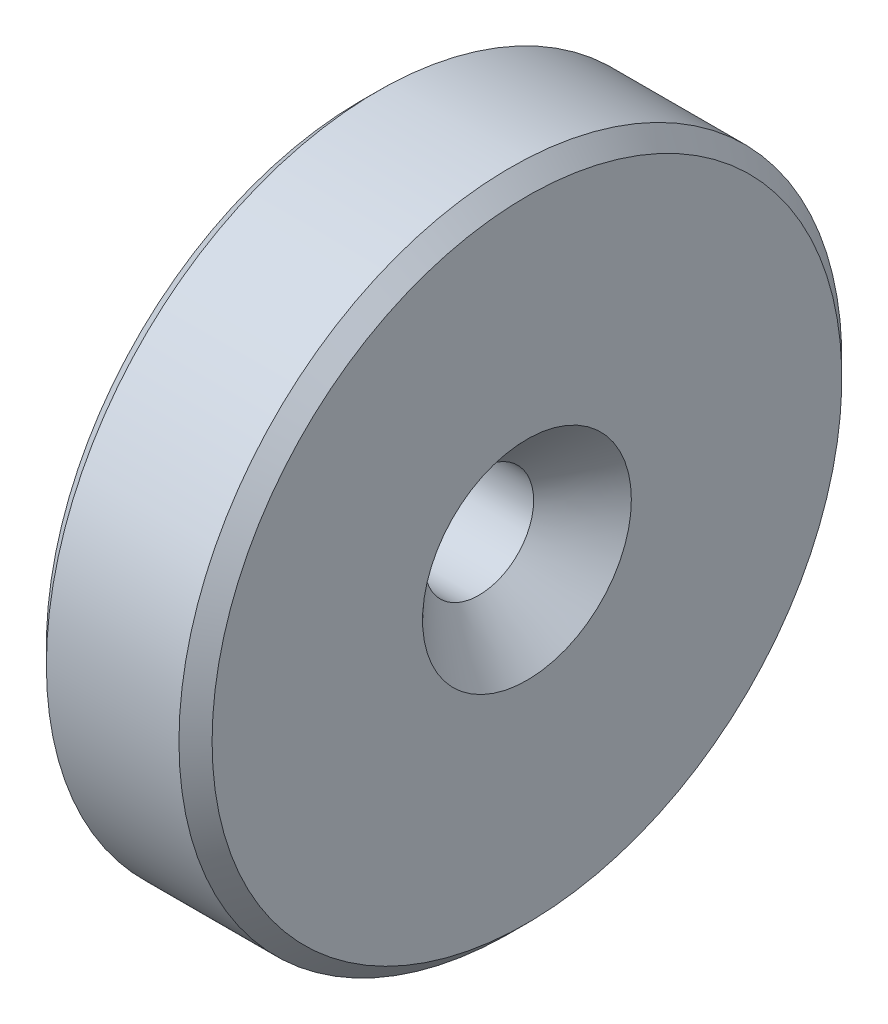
ISO-10303-21;
HEADER;
FILE_DESCRIPTION(('STEP AP214'),'2;1');
FILE_NAME('part.step','',(''),(''),'','','');
FILE_SCHEMA(('AUTOMOTIVE_DESIGN { 1 0 10303 214 1 1 1 1 }'));
ENDSEC;
DATA;
#1=APPLICATION_CONTEXT('core data for automotive mechanical design processes');
#2=APPLICATION_PROTOCOL_DEFINITION('international standard','automotive_design',2000,#1);
#3=PRODUCT_CONTEXT('',#1,'mechanical');
#4=PRODUCT('Part','Part','',(#3));
#5=PRODUCT_RELATED_PRODUCT_CATEGORY('part','',(#4));
#6=PRODUCT_DEFINITION_FORMATION('','',#4);
#7=PRODUCT_DEFINITION_CONTEXT('part definition',#1,'design');
#8=PRODUCT_DEFINITION('design','',#6,#7);
#9=PRODUCT_DEFINITION_SHAPE('','',#8);
#10=(LENGTH_UNIT() NAMED_UNIT(*) SI_UNIT(.MILLI.,.METRE.));
#11=(NAMED_UNIT(*) PLANE_ANGLE_UNIT() SI_UNIT($,.RADIAN.));
#12=(NAMED_UNIT(*) SI_UNIT($,.STERADIAN.) SOLID_ANGLE_UNIT());
#13=UNCERTAINTY_MEASURE_WITH_UNIT(LENGTH_MEASURE(1.E-05),#10,'distance_accuracy_value','');
#14=(GEOMETRIC_REPRESENTATION_CONTEXT(3) GLOBAL_UNCERTAINTY_ASSIGNED_CONTEXT((#13)) GLOBAL_UNIT_ASSIGNED_CONTEXT((#10,
#11,#12)) REPRESENTATION_CONTEXT('',''));
#15=CARTESIAN_POINT('',(0.,0.,0.));
#16=DIRECTION('',(0.,0.,1.));
#17=DIRECTION('',(1.,0.,0.));
#18=AXIS2_PLACEMENT_3D('',#15,#16,#17);
#19=CARTESIAN_POINT('',(0.,0.,0.));
#20=DIRECTION('',(1.,0.,0.));
#21=DIRECTION('',(0.,0.,-1.));
#22=AXIS2_PLACEMENT_3D('',#19,#20,#21);
#23=PLANE('',#22);
#24=CARTESIAN_POINT('',(0.,0.,0.));
#25=DIRECTION('',(1.,0.,0.));
#26=DIRECTION('',(0.,0.,-1.));
#27=AXIS2_PLACEMENT_3D('',#24,#25,#26);
#28=CIRCLE('',#27,19.);
#29=CARTESIAN_POINT('',(0.,18.9995888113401,-0.124999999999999));
#30=VERTEX_POINT('',#29);
#31=CARTESIAN_POINT('',(0.,-18.9995888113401,-0.124999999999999));
#32=VERTEX_POINT('',#31);
#33=EDGE_CURVE('E155',#30,#32,#28,.F.);
#34=ORIENTED_EDGE('',*,*,#33,.T.);
#35=DIRECTION('',(0.,1.,0.));
#36=VECTOR('',#35,1.);
#37=CARTESIAN_POINT('',(0.,0.,-0.124999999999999));
#38=LINE('',#37,#36);
#39=CARTESIAN_POINT('',(0.,-3.29763172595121,-0.124999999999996));
#40=VERTEX_POINT('',#39);
#41=EDGE_CURVE('E110',#32,#40,#38,.T.);
#42=ORIENTED_EDGE('',*,*,#41,.T.);
#43=CARTESIAN_POINT('',(0.,0.,0.));
#44=DIRECTION('',(1.,0.,0.));
#45=DIRECTION('',(0.,0.,-1.));
#46=AXIS2_PLACEMENT_3D('',#43,#44,#45);
#47=CIRCLE('',#46,3.3);
#48=CARTESIAN_POINT('',(0.,3.29763172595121,-0.124999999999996));
#49=VERTEX_POINT('',#48);
#50=EDGE_CURVE('E156',#40,#49,#47,.T.);
#51=ORIENTED_EDGE('',*,*,#50,.T.);
#52=EDGE_CURVE('E157',#49,#30,#38,.T.);
#53=ORIENTED_EDGE('',*,*,#52,.T.);
#54=EDGE_LOOP('',(#34,#42,#51,#53));
#55=FACE_BOUND('',#54,.T.);
#56=ADVANCED_FACE('F34',(#55),#23,.F.);
#57=CARTESIAN_POINT('',(0.,-18.9995888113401,0.124999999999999));
#58=VERTEX_POINT('',#57);
#59=CARTESIAN_POINT('',(0.,18.9995888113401,0.124999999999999));
#60=VERTEX_POINT('',#59);
#61=EDGE_CURVE('E123',#58,#60,#28,.F.);
#62=ORIENTED_EDGE('',*,*,#61,.T.);
#63=DIRECTION('',(0.,-1.,0.));
#64=VECTOR('',#63,1.);
#65=CARTESIAN_POINT('',(0.,0.,0.124999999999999));
#66=LINE('',#65,#64);
#67=CARTESIAN_POINT('',(0.,3.29763172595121,0.124999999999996));
#68=VERTEX_POINT('',#67);
#69=EDGE_CURVE('E127',#60,#68,#66,.T.);
#70=ORIENTED_EDGE('',*,*,#69,.T.);
#71=CARTESIAN_POINT('',(0.,-3.29763172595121,0.124999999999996));
#72=VERTEX_POINT('',#71);
#73=EDGE_CURVE('E161',#68,#72,#47,.T.);
#74=ORIENTED_EDGE('',*,*,#73,.T.);
#75=EDGE_CURVE('E57',#72,#58,#66,.T.);
#76=ORIENTED_EDGE('',*,*,#75,.T.);
#77=EDGE_LOOP('',(#62,#70,#74,#76));
#78=FACE_BOUND('',#77,.T.);
#79=ADVANCED_FACE('F36',(#78),#23,.F.);
#80=CARTESIAN_POINT('',(0.,0.,0.));
#81=DIRECTION('',(-1.,0.,0.));
#82=DIRECTION('',(0.,0.,1.));
#83=AXIS2_PLACEMENT_3D('',#80,#81,#82);
#84=CYLINDRICAL_SURFACE('',#83,20.);
#85=CARTESIAN_POINT('',(8.99999999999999,0.,0.));
#86=DIRECTION('',(-1.,0.,0.));
#87=DIRECTION('',(0.,0.,1.));
#88=AXIS2_PLACEMENT_3D('',#85,#86,#87);
#89=CIRCLE('',#88,20.);
#90=CARTESIAN_POINT('',(8.99999999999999,0.,20.));
#91=VERTEX_POINT('',#90);
#92=EDGE_CURVE('E186',#91,#91,#89,.T.);
#93=ORIENTED_EDGE('',*,*,#92,.T.);
#94=EDGE_LOOP('',(#93));
#95=FACE_BOUND('',#94,.T.);
#96=CARTESIAN_POINT('',(1.00000000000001,0.,0.));
#97=DIRECTION('',(1.,0.,0.));
#98=DIRECTION('',(0.,0.,-1.));
#99=AXIS2_PLACEMENT_3D('',#96,#97,#98);
#100=CIRCLE('',#99,20.);
#101=CARTESIAN_POINT('',(1.00000000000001,0.,-20.));
#102=VERTEX_POINT('',#101);
#103=EDGE_CURVE('E189',#102,#102,#100,.T.);
#104=ORIENTED_EDGE('',*,*,#103,.T.);
#105=EDGE_LOOP('',(#104));
#106=FACE_BOUND('',#105,.T.);
#107=ADVANCED_FACE('F212',(#95,#106),#84,.T.);
#108=CARTESIAN_POINT('',(10.,0.,0.));
#109=DIRECTION('',(-1.,0.,0.));
#110=DIRECTION('',(0.,0.,1.));
#111=AXIS2_PLACEMENT_3D('',#108,#109,#110);
#112=PLANE('',#111);
#113=CARTESIAN_POINT('',(10.,0.,0.));
#114=DIRECTION('',(1.,0.,0.));
#115=DIRECTION('',(0.,0.,-1.));
#116=AXIS2_PLACEMENT_3D('',#113,#114,#115);
#117=CIRCLE('',#116,6.3);
#118=CARTESIAN_POINT('',(10.,0.,-6.3));
#119=VERTEX_POINT('',#118);
#120=EDGE_CURVE('E192',#119,#119,#117,.T.);
#121=ORIENTED_EDGE('',*,*,#120,.F.);
#122=EDGE_LOOP('',(#121));
#123=FACE_BOUND('',#122,.T.);
#124=CARTESIAN_POINT('',(10.,0.,0.));
#125=DIRECTION('',(-1.,0.,0.));
#126=DIRECTION('',(0.,0.,1.));
#127=AXIS2_PLACEMENT_3D('',#124,#125,#126);
#128=CIRCLE('',#127,19.);
#129=CARTESIAN_POINT('',(10.,0.,19.));
#130=VERTEX_POINT('',#129);
#131=EDGE_CURVE('E183',#130,#130,#128,.F.);
#132=ORIENTED_EDGE('',*,*,#131,.T.);
#133=EDGE_LOOP('',(#132));
#134=FACE_BOUND('',#133,.T.);
#135=ADVANCED_FACE('F216',(#123,#134),#112,.F.);
#136=CARTESIAN_POINT('',(8.99999999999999,0.,0.));
#137=DIRECTION('',(-1.,0.,0.));
#138=DIRECTION('',(0.,0.,1.));
#139=AXIS2_PLACEMENT_3D('',#136,#137,#138);
#140=CONICAL_SURFACE('',#139,20.,0.785398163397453);
#141=ORIENTED_EDGE('',*,*,#131,.F.);
#142=EDGE_LOOP('',(#141));
#143=FACE_BOUND('',#142,.T.);
#144=ORIENTED_EDGE('',*,*,#92,.F.);
#145=EDGE_LOOP('',(#144));
#146=FACE_BOUND('',#145,.T.);
#147=ADVANCED_FACE('F221',(#143,#146),#140,.T.);
#148=CARTESIAN_POINT('',(0.,0.,0.));
#149=DIRECTION('',(1.,0.,0.));
#150=DIRECTION('',(0.,0.,-1.));
#151=AXIS2_PLACEMENT_3D('',#148,#149,#150);
#152=CONICAL_SURFACE('',#151,19.,0.785398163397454);
#153=CARTESIAN_POINT('',(24.1002749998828,43.1000937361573,-0.124999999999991));
#154=CARTESIAN_POINT('',(21.1248248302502,40.1246305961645,-0.124999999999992));
#155=CARTESIAN_POINT('',(18.149375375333,37.1491667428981,-0.124999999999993));
#156=CARTESIAN_POINT('',(12.1984820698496,31.1982334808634,-0.124999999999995));
#157=CARTESIAN_POINT('',(9.2230382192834,28.2227640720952,-0.124999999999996));
#158=CARTESIAN_POINT('',(3.27216738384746,22.2718226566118,-0.124999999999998));
#159=CARTESIAN_POINT('',(0.296740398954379,19.2963506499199,-0.124999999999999));
#160=CARTESIAN_POINT('',(-4.16636716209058,14.8331096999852,-0.125000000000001));
#161=CARTESIAN_POINT('',(-5.65406420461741,13.3453572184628,-0.125000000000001));
#162=CARTESIAN_POINT('',(-8.62943346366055,10.3698274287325,-0.125000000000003));
#163=CARTESIAN_POINT('',(-10.117105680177,8.88205012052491,-0.125000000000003));
#164=CARTESIAN_POINT('',(-12.4205669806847,6.57826009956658,-0.125000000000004));
#165=CARTESIAN_POINT('',(-13.2363935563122,5.76228485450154,-0.125000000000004));
#166=CARTESIAN_POINT('',(-14.5979126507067,4.40033576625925,-0.125000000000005));
#167=CARTESIAN_POINT('',(-15.1436352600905,3.85439203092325,-0.125000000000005));
#168=CARTESIAN_POINT('',(-16.0543039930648,2.94307591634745,-0.125000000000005));
#169=CARTESIAN_POINT('',(-16.4192962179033,2.57774956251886,-0.125000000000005));
#170=CARTESIAN_POINT('',(-17.0282658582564,1.96782132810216,-0.125000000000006));
#171=CARTESIAN_POINT('',(-17.2723096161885,1.72328581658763,-0.125000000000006));
#172=CARTESIAN_POINT('',(-17.6793012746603,1.3148423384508,-0.125000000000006));
#173=CARTESIAN_POINT('',(-17.8423538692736,1.15103856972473,-0.125000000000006));
#174=CARTESIAN_POINT('',(-18.1140495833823,0.877212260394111,-0.125000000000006));
#175=CARTESIAN_POINT('',(-18.2228380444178,0.767334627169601,-0.125000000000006));
#176=CARTESIAN_POINT('',(-18.3674335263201,0.62012660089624,-0.125000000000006));
#177=CARTESIAN_POINT('',(-18.4036294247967,0.583178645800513,-0.125000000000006));
#178=CARTESIAN_POINT('',(-18.4758404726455,0.509106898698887,-0.125000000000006));
#179=CARTESIAN_POINT('',(-18.5118556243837,0.471983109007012,-0.125000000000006));
#180=CARTESIAN_POINT('',(-18.571682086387,0.409728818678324,-0.125000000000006));
#181=CARTESIAN_POINT('',(-18.5955906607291,0.384691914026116,-0.125000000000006));
#182=CARTESIAN_POINT('',(-18.6431250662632,0.334372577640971,-0.125000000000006));
#183=CARTESIAN_POINT('',(-18.6667510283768,0.309090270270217,-0.125000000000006));
#184=CARTESIAN_POINT('',(-18.705746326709,0.266471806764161,-0.125000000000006));
#185=CARTESIAN_POINT('',(-18.7212632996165,0.249271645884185,-0.125000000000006));
#186=CARTESIAN_POINT('',(-18.7518975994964,0.21447337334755,-0.125000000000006));
#187=CARTESIAN_POINT('',(-18.7670143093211,0.196874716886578,-0.125000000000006));
#188=CARTESIAN_POINT('',(-18.7947680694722,0.163035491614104,-0.125000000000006));
#189=CARTESIAN_POINT('',(-18.8074915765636,0.14686817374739,-0.125000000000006));
#190=CARTESIAN_POINT('',(-18.8255214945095,0.121860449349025,-0.125000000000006));
#191=CARTESIAN_POINT('',(-18.8313528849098,0.113402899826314,-0.125000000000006));
#192=CARTESIAN_POINT('',(-18.8424512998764,0.0961292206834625,-0.125000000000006));
#193=CARTESIAN_POINT('',(-18.8477189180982,0.0873134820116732,-0.125000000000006));
#194=CARTESIAN_POINT('',(-18.856726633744,0.0703361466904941,-0.125000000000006));
#195=CARTESIAN_POINT('',(-18.860575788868,0.0622338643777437,-0.125000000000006));
#196=CARTESIAN_POINT('',(-18.8671632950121,0.0455901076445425,-0.125000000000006));
#197=CARTESIAN_POINT('',(-18.8699046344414,0.0370498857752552,-0.125000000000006));
#198=CARTESIAN_POINT('',(-18.8734188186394,0.0211330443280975,-0.125000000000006));
#199=CARTESIAN_POINT('',(-18.874453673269,0.0138170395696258,-0.125000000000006));
#200=CARTESIAN_POINT('',(-18.8752114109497,-0.000872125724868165,-0.125000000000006));
#201=CARTESIAN_POINT('',(-18.874936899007,-0.00824514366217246,-0.125000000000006));
#202=CARTESIAN_POINT('',(-18.8729404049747,-0.0244426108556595,-0.125000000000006));
#203=CARTESIAN_POINT('',(-18.8709118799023,-0.0332276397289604,-0.125000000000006));
#204=CARTESIAN_POINT('',(-18.8654766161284,-0.0503847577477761,-0.125000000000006));
#205=CARTESIAN_POINT('',(-18.8620618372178,-0.0587541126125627,-0.125000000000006));
#206=CARTESIAN_POINT('',(-18.8507261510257,-0.0828103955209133,-0.125000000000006));
#207=CARTESIAN_POINT('',(-18.8416035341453,-0.0979074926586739,-0.125000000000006));
#208=CARTESIAN_POINT('',(-18.8219838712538,-0.127200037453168,-0.125000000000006));
#209=CARTESIAN_POINT('',(-18.8114803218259,-0.141390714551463,-0.125000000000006));
#210=CARTESIAN_POINT('',(-18.789673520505,-0.169379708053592,-0.125000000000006));
#211=CARTESIAN_POINT('',(-18.778363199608,-0.183172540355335,-0.125000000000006));
#212=CARTESIAN_POINT('',(-18.7553839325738,-0.210390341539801,-0.125000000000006));
#213=CARTESIAN_POINT('',(-18.7437159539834,-0.223816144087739,-0.125000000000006));
#214=CARTESIAN_POINT('',(-18.7088802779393,-0.263204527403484,-0.125000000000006));
#215=CARTESIAN_POINT('',(-18.6853861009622,-0.288877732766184,-0.125000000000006));
#216=CARTESIAN_POINT('',(-18.6380003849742,-0.3398557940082,-0.125000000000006));
#217=CARTESIAN_POINT('',(-18.6141087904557,-0.365160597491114,-0.125000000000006));
#218=CARTESIAN_POINT('',(-18.5420591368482,-0.440829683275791,-0.125000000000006));
#219=CARTESIAN_POINT('',(-18.4935810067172,-0.490889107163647,-0.125000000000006));
#220=CARTESIAN_POINT('',(-18.3967367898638,-0.590265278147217,-0.125000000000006));
#221=CARTESIAN_POINT('',(-18.3483734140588,-0.639584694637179,-0.125000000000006));
#222=CARTESIAN_POINT('',(-18.2515032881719,-0.738038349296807,-0.125000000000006));
#223=CARTESIAN_POINT('',(-18.202996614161,-0.787172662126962,-0.125000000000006));
#224=CARTESIAN_POINT('',(-18.0571890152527,-0.93460253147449,-0.125000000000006));
#225=CARTESIAN_POINT('',(-17.9597557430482,-1.03276693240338,-0.125000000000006));
#226=CARTESIAN_POINT('',(-17.7647472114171,-1.22895515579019,-0.125000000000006));
#227=CARTESIAN_POINT('',(-17.6671719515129,-1.32697897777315,-0.125000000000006));
#228=CARTESIAN_POINT('',(-17.3743041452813,-1.62097790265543,-0.125000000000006));
#229=CARTESIAN_POINT('',(-17.1789040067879,-1.81684579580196,-0.125000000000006));
#230=CARTESIAN_POINT('',(-16.7873393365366,-2.20915627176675,-0.125000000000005));
#231=CARTESIAN_POINT('',(-16.5911744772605,-2.40559852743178,-0.125000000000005));
#232=CARTESIAN_POINT('',(-16.1988045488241,-2.79842093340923,-0.125000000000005));
#233=CARTESIAN_POINT('',(-16.0025994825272,-2.9948010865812,-0.125000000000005));
#234=CARTESIAN_POINT('',(-15.0221453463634,-3.97601577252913,-0.125000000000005));
#235=CARTESIAN_POINT('',(-14.2377249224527,-4.76067905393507,-0.125000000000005));
#236=CARTESIAN_POINT('',(-12.6688121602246,-6.32996653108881,-0.125000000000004));
#237=CARTESIAN_POINT('',(-11.8843198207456,-7.11459072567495,-0.125000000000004));
#238=CARTESIAN_POINT('',(-10.3167642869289,-8.68234705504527,-0.125000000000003));
#239=CARTESIAN_POINT('',(-9.53370115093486,-9.46547924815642,-0.125000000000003));
#240=CARTESIAN_POINT('',(-7.96756817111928,-11.031726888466,-0.125000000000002));
#241=CARTESIAN_POINT('',(-7.18449832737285,-11.8148423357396,-0.125000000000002));
#242=CARTESIAN_POINT('',(-3.86502376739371,-15.1344831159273,-0.125000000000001));
#243=CARTESIAN_POINT('',(-1.32858871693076,-17.6709781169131,-0.125));
#244=CARTESIAN_POINT('',(3.7443018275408,-22.7439617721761,-0.124999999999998));
#245=CARTESIAN_POINT('',(6.28075732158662,-25.280450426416,-0.124999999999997));
#246=CARTESIAN_POINT('',(11.3643915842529,-30.364136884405,-0.124999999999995));
#247=CARTESIAN_POINT('',(13.911570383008,-32.9113346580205,-0.124999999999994));
#248=CARTESIAN_POINT('',(19.0059244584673,-38.0057195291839,-0.124999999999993));
#249=CARTESIAN_POINT('',(21.5530997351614,-40.5529066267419,-0.124999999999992));
#250=CARTESIAN_POINT('',(24.1002749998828,-43.1000937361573,-0.124999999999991));
#251=B_SPLINE_CURVE_WITH_KNOTS('',3,(#153,#154,#155,#156,#157,#158,#159,#160,#161,#162,#163,
#164,#165,#166,#167,#168,#169,#170,#171,#172,#173,#174,#175,#176,#177,#178,#179,#180,#181,#182,
#183,#184,#185,#186,#187,#188,#189,#190,#191,#192,#193,#194,#195,#196,#197,#198,#199,#200,#201,
#202,#203,#204,#205,#206,#207,#208,#209,#210,#211,#212,#213,#214,#215,#216,#217,#218,#219,#220,
#221,#222,#223,#224,#225,#226,#227,#228,#229,#230,#231,#232,#233,#234,#235,#236,#237,#238,#239,
#240,#241,#242,#243,#244,#245,#246,#247,#248,#249,#250),.UNSPECIFIED.,.F.,.F.,(4,2,2,2,2,2,2,2,
2,2,2,2,2,2,2,2,2,2,2,2,2,2,2,2,2,2,2,2,2,2,2,2,2,2,2,2,2,2,2,2,2,2,2,2,2,2,2,2,4),(0.,
12.6237934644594,25.2475868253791,37.8713499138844,44.1832315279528,50.4951131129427,
53.9566875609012,56.2724615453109,57.8217015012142,58.8581347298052,59.5515039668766,
60.0153681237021,60.1705376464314,60.3257051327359,60.4295608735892,60.5333664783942,
60.6028571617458,60.6724493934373,60.7341248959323,60.7649313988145,60.7957051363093,
60.8225667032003,60.8493553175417,60.8714165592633,60.8934339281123,60.9203181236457,
60.9473605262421,61.0000559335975,61.0530090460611,61.1065027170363,61.1598626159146,
61.2642516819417,61.3686554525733,61.5777057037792,61.7849325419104,61.9920641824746,
62.4069921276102,62.8219214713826,63.651926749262,64.4847724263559,65.3175715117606,
68.6461006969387,71.9746995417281,75.2971015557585,78.6194822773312,89.3807919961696,
100.142131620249,110.948936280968,121.755710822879),.UNSPECIFIED.);
#252=CARTESIAN_POINT('',(0.0999999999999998,-19.0995909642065,-0.124999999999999));
#253=VERTEX_POINT('',#252);
#254=EDGE_CURVE('E159',#32,#253,#251,.T.);
#255=ORIENTED_EDGE('',*,*,#254,.F.);
#256=ORIENTED_EDGE('',*,*,#33,.F.);
#257=CARTESIAN_POINT('',(0.0999999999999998,19.0995909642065,-0.124999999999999));
#258=VERTEX_POINT('',#257);
#259=EDGE_CURVE('E146',#258,#30,#251,.T.);
#260=ORIENTED_EDGE('',*,*,#259,.F.);
#261=CARTESIAN_POINT('',(0.0999999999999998,0.,0.));
#262=DIRECTION('',(1.,0.,0.));
#263=DIRECTION('',(0.,0.,-1.));
#264=AXIS2_PLACEMENT_3D('',#261,#262,#263);
#265=CIRCLE('',#264,19.1);
#266=CARTESIAN_POINT('',(0.0999999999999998,19.0995909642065,0.124999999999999));
#267=VERTEX_POINT('',#266);
#268=EDGE_CURVE('E111',#267,#258,#265,.F.);
#269=ORIENTED_EDGE('',*,*,#268,.F.);
#270=CARTESIAN_POINT('',(24.1002749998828,-43.1000937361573,0.124999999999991));
#271=CARTESIAN_POINT('',(21.1248248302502,-40.1246305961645,0.124999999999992));
#272=CARTESIAN_POINT('',(18.149375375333,-37.1491667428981,0.124999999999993));
#273=CARTESIAN_POINT('',(12.1984820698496,-31.1982334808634,0.124999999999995));
#274=CARTESIAN_POINT('',(9.2230382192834,-28.2227640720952,0.124999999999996));
#275=CARTESIAN_POINT('',(3.27216738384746,-22.2718226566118,0.124999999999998));
#276=CARTESIAN_POINT('',(0.296740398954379,-19.2963506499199,0.124999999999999));
#277=CARTESIAN_POINT('',(-4.16636716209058,-14.8331096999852,0.125000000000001));
#278=CARTESIAN_POINT('',(-5.65406420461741,-13.3453572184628,0.125000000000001));
#279=CARTESIAN_POINT('',(-8.62943346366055,-10.3698274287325,0.125000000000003));
#280=CARTESIAN_POINT('',(-10.117105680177,-8.88205012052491,0.125000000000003));
#281=CARTESIAN_POINT('',(-12.4205669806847,-6.57826009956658,0.125000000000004));
#282=CARTESIAN_POINT('',(-13.2363935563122,-5.76228485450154,0.125000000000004));
#283=CARTESIAN_POINT('',(-14.5979126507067,-4.40033576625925,0.125000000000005));
#284=CARTESIAN_POINT('',(-15.1436352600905,-3.85439203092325,0.125000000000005));
#285=CARTESIAN_POINT('',(-16.0543039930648,-2.94307591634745,0.125000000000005));
#286=CARTESIAN_POINT('',(-16.4192962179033,-2.57774956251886,0.125000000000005));
#287=CARTESIAN_POINT('',(-17.0282658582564,-1.96782132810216,0.125000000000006));
#288=CARTESIAN_POINT('',(-17.2723096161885,-1.72328581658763,0.125000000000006));
#289=CARTESIAN_POINT('',(-17.6793012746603,-1.3148423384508,0.125000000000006));
#290=CARTESIAN_POINT('',(-17.8423538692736,-1.15103856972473,0.125000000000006));
#291=CARTESIAN_POINT('',(-18.1140495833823,-0.877212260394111,0.125000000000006));
#292=CARTESIAN_POINT('',(-18.2228380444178,-0.767334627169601,0.125000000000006));
#293=CARTESIAN_POINT('',(-18.3674335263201,-0.62012660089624,0.125000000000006));
#294=CARTESIAN_POINT('',(-18.4036294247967,-0.583178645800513,0.125000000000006));
#295=CARTESIAN_POINT('',(-18.4758404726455,-0.509106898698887,0.125000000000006));
#296=CARTESIAN_POINT('',(-18.5118556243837,-0.471983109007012,0.125000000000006));
#297=CARTESIAN_POINT('',(-18.571682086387,-0.409728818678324,0.125000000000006));
#298=CARTESIAN_POINT('',(-18.5955906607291,-0.384691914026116,0.125000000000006));
#299=CARTESIAN_POINT('',(-18.6431250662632,-0.334372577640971,0.125000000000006));
#300=CARTESIAN_POINT('',(-18.6667510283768,-0.309090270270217,0.125000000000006));
#301=CARTESIAN_POINT('',(-18.705746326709,-0.266471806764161,0.125000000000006));
#302=CARTESIAN_POINT('',(-18.7212632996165,-0.249271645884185,0.125000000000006));
#303=CARTESIAN_POINT('',(-18.7518975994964,-0.21447337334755,0.125000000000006));
#304=CARTESIAN_POINT('',(-18.7670143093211,-0.196874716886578,0.125000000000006));
#305=CARTESIAN_POINT('',(-18.7947680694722,-0.163035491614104,0.125000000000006));
#306=CARTESIAN_POINT('',(-18.8074915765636,-0.14686817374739,0.125000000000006));
#307=CARTESIAN_POINT('',(-18.8255214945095,-0.121860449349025,0.125000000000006));
#308=CARTESIAN_POINT('',(-18.8313528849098,-0.113402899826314,0.125000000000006));
#309=CARTESIAN_POINT('',(-18.8424512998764,-0.0961292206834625,0.125000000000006));
#310=CARTESIAN_POINT('',(-18.8477189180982,-0.0873134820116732,0.125000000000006));
#311=CARTESIAN_POINT('',(-18.856726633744,-0.0703361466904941,0.125000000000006));
#312=CARTESIAN_POINT('',(-18.860575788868,-0.0622338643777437,0.125000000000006));
#313=CARTESIAN_POINT('',(-18.8671632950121,-0.0455901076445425,0.125000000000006));
#314=CARTESIAN_POINT('',(-18.8699046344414,-0.0370498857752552,0.125000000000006));
#315=CARTESIAN_POINT('',(-18.8734188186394,-0.0211330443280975,0.125000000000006));
#316=CARTESIAN_POINT('',(-18.874453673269,-0.0138170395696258,0.125000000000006));
#317=CARTESIAN_POINT('',(-18.8752114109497,0.000872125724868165,0.125000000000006));
#318=CARTESIAN_POINT('',(-18.874936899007,0.00824514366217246,0.125000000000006));
#319=CARTESIAN_POINT('',(-18.8729404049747,0.0244426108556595,0.125000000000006));
#320=CARTESIAN_POINT('',(-18.8709118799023,0.0332276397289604,0.125000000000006));
#321=CARTESIAN_POINT('',(-18.8654766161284,0.0503847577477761,0.125000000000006));
#322=CARTESIAN_POINT('',(-18.8620618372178,0.0587541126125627,0.125000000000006));
#323=CARTESIAN_POINT('',(-18.8507261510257,0.0828103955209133,0.125000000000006));
#324=CARTESIAN_POINT('',(-18.8416035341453,0.0979074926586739,0.125000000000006));
#325=CARTESIAN_POINT('',(-18.8219838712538,0.127200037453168,0.125000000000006));
#326=CARTESIAN_POINT('',(-18.8114803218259,0.141390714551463,0.125000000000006));
#327=CARTESIAN_POINT('',(-18.789673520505,0.169379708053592,0.125000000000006));
#328=CARTESIAN_POINT('',(-18.778363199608,0.183172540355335,0.125000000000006));
#329=CARTESIAN_POINT('',(-18.7553839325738,0.210390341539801,0.125000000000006));
#330=CARTESIAN_POINT('',(-18.7437159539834,0.223816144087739,0.125000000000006));
#331=CARTESIAN_POINT('',(-18.7088802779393,0.263204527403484,0.125000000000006));
#332=CARTESIAN_POINT('',(-18.6853861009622,0.288877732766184,0.125000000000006));
#333=CARTESIAN_POINT('',(-18.6380003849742,0.3398557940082,0.125000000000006));
#334=CARTESIAN_POINT('',(-18.6141087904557,0.365160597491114,0.125000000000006));
#335=CARTESIAN_POINT('',(-18.5420591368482,0.440829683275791,0.125000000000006));
#336=CARTESIAN_POINT('',(-18.4935810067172,0.490889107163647,0.125000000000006));
#337=CARTESIAN_POINT('',(-18.3967367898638,0.590265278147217,0.125000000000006));
#338=CARTESIAN_POINT('',(-18.3483734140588,0.639584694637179,0.125000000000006));
#339=CARTESIAN_POINT('',(-18.2515032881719,0.738038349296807,0.125000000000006));
#340=CARTESIAN_POINT('',(-18.202996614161,0.787172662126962,0.125000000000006));
#341=CARTESIAN_POINT('',(-18.0571890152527,0.93460253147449,0.125000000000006));
#342=CARTESIAN_POINT('',(-17.9597557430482,1.03276693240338,0.125000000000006));
#343=CARTESIAN_POINT('',(-17.7647472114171,1.22895515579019,0.125000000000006));
#344=CARTESIAN_POINT('',(-17.6671719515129,1.32697897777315,0.125000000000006));
#345=CARTESIAN_POINT('',(-17.3743041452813,1.62097790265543,0.125000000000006));
#346=CARTESIAN_POINT('',(-17.1789040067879,1.81684579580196,0.125000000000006));
#347=CARTESIAN_POINT('',(-16.7873393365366,2.20915627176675,0.125000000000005));
#348=CARTESIAN_POINT('',(-16.5911744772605,2.40559852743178,0.125000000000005));
#349=CARTESIAN_POINT('',(-16.1988045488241,2.79842093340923,0.125000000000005));
#350=CARTESIAN_POINT('',(-16.0025994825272,2.9948010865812,0.125000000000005));
#351=CARTESIAN_POINT('',(-15.0221453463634,3.97601577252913,0.125000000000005));
#352=CARTESIAN_POINT('',(-14.2377249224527,4.76067905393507,0.125000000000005));
#353=CARTESIAN_POINT('',(-12.6688121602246,6.32996653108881,0.125000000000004));
#354=CARTESIAN_POINT('',(-11.8843198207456,7.11459072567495,0.125000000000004));
#355=CARTESIAN_POINT('',(-10.3167642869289,8.68234705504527,0.125000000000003));
#356=CARTESIAN_POINT('',(-9.53370115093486,9.46547924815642,0.125000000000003));
#357=CARTESIAN_POINT('',(-7.96756817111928,11.031726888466,0.125000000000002));
#358=CARTESIAN_POINT('',(-7.18449832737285,11.8148423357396,0.125000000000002));
#359=CARTESIAN_POINT('',(-3.86502376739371,15.1344831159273,0.125000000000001));
#360=CARTESIAN_POINT('',(-1.32858871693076,17.6709781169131,0.125));
#361=CARTESIAN_POINT('',(3.7443018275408,22.7439617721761,0.124999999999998));
#362=CARTESIAN_POINT('',(6.28075732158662,25.280450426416,0.124999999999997));
#363=CARTESIAN_POINT('',(11.3643915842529,30.364136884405,0.124999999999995));
#364=CARTESIAN_POINT('',(13.911570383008,32.9113346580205,0.124999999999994));
#365=CARTESIAN_POINT('',(19.0059244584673,38.0057195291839,0.124999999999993));
#366=CARTESIAN_POINT('',(21.5530997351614,40.5529066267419,0.124999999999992));
#367=CARTESIAN_POINT('',(24.1002749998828,43.1000937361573,0.124999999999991));
#368=B_SPLINE_CURVE_WITH_KNOTS('',3,(#270,#271,#272,#273,#274,#275,#276,#277,#278,#279,#280,
#281,#282,#283,#284,#285,#286,#287,#288,#289,#290,#291,#292,#293,#294,#295,#296,#297,#298,#299,
#300,#301,#302,#303,#304,#305,#306,#307,#308,#309,#310,#311,#312,#313,#314,#315,#316,#317,#318,
#319,#320,#321,#322,#323,#324,#325,#326,#327,#328,#329,#330,#331,#332,#333,#334,#335,#336,#337,
#338,#339,#340,#341,#342,#343,#344,#345,#346,#347,#348,#349,#350,#351,#352,#353,#354,#355,#356,
#357,#358,#359,#360,#361,#362,#363,#364,#365,#366,#367),.UNSPECIFIED.,.F.,.F.,(4,2,2,2,2,2,2,2,
2,2,2,2,2,2,2,2,2,2,2,2,2,2,2,2,2,2,2,2,2,2,2,2,2,2,2,2,2,2,2,2,2,2,2,2,2,2,2,2,4),(0.,
12.6237934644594,25.2475868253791,37.8713499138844,44.1832315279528,50.4951131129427,
53.9566875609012,56.2724615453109,57.8217015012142,58.8581347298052,59.5515039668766,
60.0153681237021,60.1705376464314,60.3257051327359,60.4295608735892,60.5333664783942,
60.6028571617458,60.6724493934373,60.7341248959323,60.7649313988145,60.7957051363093,
60.8225667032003,60.8493553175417,60.8714165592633,60.8934339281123,60.9203181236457,
60.9473605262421,61.0000559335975,61.0530090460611,61.1065027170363,61.1598626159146,
61.2642516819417,61.3686554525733,61.5777057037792,61.7849325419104,61.9920641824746,
62.4069921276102,62.8219214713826,63.651926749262,64.4847724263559,65.3175715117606,
68.6461006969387,71.9746995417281,75.2971015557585,78.6194822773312,89.3807919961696,
100.142131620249,110.948936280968,121.755710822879),.UNSPECIFIED.);
#369=EDGE_CURVE('E125',#60,#267,#368,.T.);
#370=ORIENTED_EDGE('',*,*,#369,.F.);
#371=ORIENTED_EDGE('',*,*,#61,.F.);
#372=CARTESIAN_POINT('',(0.0999999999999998,-19.0995909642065,0.124999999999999));
#373=VERTEX_POINT('',#372);
#374=EDGE_CURVE('E114',#373,#58,#368,.T.);
#375=ORIENTED_EDGE('',*,*,#374,.F.);
#376=EDGE_CURVE('E100',#253,#373,#265,.F.);
#377=ORIENTED_EDGE('',*,*,#376,.F.);
#378=EDGE_LOOP('',(#255,#256,#260,#269,#370,#371,#375,#377));
#379=FACE_BOUND('',#378,.T.);
#380=ORIENTED_EDGE('',*,*,#103,.F.);
#381=EDGE_LOOP('',(#380));
#382=FACE_BOUND('',#381,.T.);
#383=ADVANCED_FACE('F119',(#379,#382),#152,.T.);
#384=CARTESIAN_POINT('',(10.,0.,0.));
#385=DIRECTION('',(1.,0.,0.));
#386=DIRECTION('',(0.,0.,-1.));
#387=AXIS2_PLACEMENT_3D('',#384,#385,#386);
#388=CONICAL_SURFACE('',#387,6.3,0.802851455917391);
#389=CARTESIAN_POINT('',(7.10293367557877,0.,0.));
#390=DIRECTION('',(1.,0.,0.));
#391=DIRECTION('',(0.,0.,-1.));
#392=AXIS2_PLACEMENT_3D('',#389,#390,#391);
#393=CIRCLE('',#392,3.3);
#394=CARTESIAN_POINT('',(7.10293367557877,0.,-3.3));
#395=VERTEX_POINT('',#394);
#396=EDGE_CURVE('E195',#395,#395,#393,.T.);
#397=ORIENTED_EDGE('',*,*,#396,.F.);
#398=EDGE_LOOP('',(#397));
#399=FACE_BOUND('',#398,.T.);
#400=ORIENTED_EDGE('',*,*,#120,.T.);
#401=EDGE_LOOP('',(#400));
#402=FACE_BOUND('',#401,.T.);
#403=ADVANCED_FACE('F231',(#399,#402),#388,.F.);
#404=CARTESIAN_POINT('',(10.,0.,0.));
#405=DIRECTION('',(1.,0.,0.));
#406=DIRECTION('',(0.,0.,-1.));
#407=AXIS2_PLACEMENT_3D('',#404,#405,#406);
#408=CYLINDRICAL_SURFACE('',#407,3.3);
#409=ORIENTED_EDGE('',*,*,#50,.F.);
#410=DIRECTION('',(1.,0.,0.));
#411=VECTOR('',#410,1.);
#412=CARTESIAN_POINT('',(10.,-3.29763172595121,-0.124999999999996));
#413=LINE('',#412,#411);
#414=CARTESIAN_POINT('',(0.0999999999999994,-3.29763172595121,-0.124999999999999));
#415=VERTEX_POINT('',#414);
#416=EDGE_CURVE('E11',#40,#415,#413,.T.);
#417=ORIENTED_EDGE('',*,*,#416,.T.);
#418=CARTESIAN_POINT('',(0.0999999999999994,0.,0.));
#419=DIRECTION('',(1.,0.,0.));
#420=DIRECTION('',(0.,0.,-1.));
#421=AXIS2_PLACEMENT_3D('',#418,#419,#420);
#422=CIRCLE('',#421,3.3);
#423=CARTESIAN_POINT('',(0.0999999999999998,-3.29763172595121,0.124999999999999));
#424=VERTEX_POINT('',#423);
#425=EDGE_CURVE('E42',#415,#424,#422,.F.);
#426=ORIENTED_EDGE('',*,*,#425,.T.);
#427=DIRECTION('',(1.,0.,0.));
#428=VECTOR('',#427,1.);
#429=CARTESIAN_POINT('',(10.,-3.29763172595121,0.124999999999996));
#430=LINE('',#429,#428);
#431=EDGE_CURVE('E115',#424,#72,#430,.F.);
#432=ORIENTED_EDGE('',*,*,#431,.T.);
#433=ORIENTED_EDGE('',*,*,#73,.F.);
#434=DIRECTION('',(1.,0.,0.));
#435=VECTOR('',#434,1.);
#436=CARTESIAN_POINT('',(10.,3.29763172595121,0.124999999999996));
#437=LINE('',#436,#435);
#438=CARTESIAN_POINT('',(0.0999999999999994,3.29763172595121,0.124999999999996));
#439=VERTEX_POINT('',#438);
#440=EDGE_CURVE('E178',#68,#439,#437,.T.);
#441=ORIENTED_EDGE('',*,*,#440,.T.);
#442=CARTESIAN_POINT('',(0.0999999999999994,3.29763172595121,-0.124999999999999));
#443=VERTEX_POINT('',#442);
#444=EDGE_CURVE('E176',#439,#443,#422,.F.);
#445=ORIENTED_EDGE('',*,*,#444,.T.);
#446=DIRECTION('',(1.,0.,0.));
#447=VECTOR('',#446,1.);
#448=CARTESIAN_POINT('',(10.,3.29763172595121,-0.124999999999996));
#449=LINE('',#448,#447);
#450=EDGE_CURVE('E149',#443,#49,#449,.F.);
#451=ORIENTED_EDGE('',*,*,#450,.T.);
#452=EDGE_LOOP('',(#409,#417,#426,#432,#433,#441,#445,#451));
#453=FACE_BOUND('',#452,.T.);
#454=ORIENTED_EDGE('',*,*,#396,.T.);
#455=EDGE_LOOP('',(#454));
#456=FACE_BOUND('',#455,.T.);
#457=ADVANCED_FACE('F173',(#453,#456),#408,.F.);
#458=CARTESIAN_POINT('',(-2.,-20.,0.125));
#459=DIRECTION('',(0.,0.,1.));
#460=DIRECTION('',(1.,0.,0.));
#461=AXIS2_PLACEMENT_3D('',#458,#459,#460);
#462=PLANE('',#461);
#463=ORIENTED_EDGE('',*,*,#369,.T.);
#464=DIRECTION('',(0.,1.,0.));
#465=VECTOR('',#464,1.);
#466=CARTESIAN_POINT('',(0.0999999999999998,-20.,0.124999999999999));
#467=LINE('',#466,#465);
#468=EDGE_CURVE('E49',#439,#267,#467,.T.);
#469=ORIENTED_EDGE('',*,*,#468,.F.);
#470=ORIENTED_EDGE('',*,*,#440,.F.);
#471=ORIENTED_EDGE('',*,*,#69,.F.);
#472=EDGE_LOOP('',(#463,#469,#470,#471));
#473=FACE_BOUND('',#472,.T.);
#474=ADVANCED_FACE('F203',(#473),#462,.F.);
#475=CARTESIAN_POINT('',(0.0999999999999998,-20.,-0.124999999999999));
#476=DIRECTION('',(1.,0.,0.));
#477=DIRECTION('',(0.,0.,-1.));
#478=AXIS2_PLACEMENT_3D('',#475,#476,#477);
#479=PLANE('',#478);
#480=ORIENTED_EDGE('',*,*,#268,.T.);
#481=DIRECTION('',(0.,1.,0.));
#482=VECTOR('',#481,1.);
#483=CARTESIAN_POINT('',(0.0999999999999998,-20.,-0.124999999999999));
#484=LINE('',#483,#482);
#485=EDGE_CURVE('E116',#443,#258,#484,.T.);
#486=ORIENTED_EDGE('',*,*,#485,.F.);
#487=ORIENTED_EDGE('',*,*,#444,.F.);
#488=ORIENTED_EDGE('',*,*,#468,.T.);
#489=EDGE_LOOP('',(#480,#486,#487,#488));
#490=FACE_BOUND('',#489,.T.);
#491=ADVANCED_FACE('F207',(#490),#479,.F.);
#492=CARTESIAN_POINT('',(-2.,-20.,-0.125));
#493=DIRECTION('',(0.,0.,-1.));
#494=DIRECTION('',(-1.,0.,0.));
#495=AXIS2_PLACEMENT_3D('',#492,#493,#494);
#496=PLANE('',#495);
#497=ORIENTED_EDGE('',*,*,#259,.T.);
#498=ORIENTED_EDGE('',*,*,#52,.F.);
#499=ORIENTED_EDGE('',*,*,#450,.F.);
#500=ORIENTED_EDGE('',*,*,#485,.T.);
#501=EDGE_LOOP('',(#497,#498,#499,#500));
#502=FACE_BOUND('',#501,.T.);
#503=ADVANCED_FACE('F145',(#502),#496,.F.);
#504=ORIENTED_EDGE('',*,*,#376,.T.);
#505=EDGE_CURVE('E103',#373,#424,#467,.T.);
#506=ORIENTED_EDGE('',*,*,#505,.T.);
#507=ORIENTED_EDGE('',*,*,#425,.F.);
#508=EDGE_CURVE('E106',#253,#415,#484,.T.);
#509=ORIENTED_EDGE('',*,*,#508,.F.);
#510=EDGE_LOOP('',(#504,#506,#507,#509));
#511=FACE_BOUND('',#510,.T.);
#512=ADVANCED_FACE('F102',(#511),#479,.F.);
#513=ORIENTED_EDGE('',*,*,#374,.T.);
#514=ORIENTED_EDGE('',*,*,#75,.F.);
#515=ORIENTED_EDGE('',*,*,#431,.F.);
#516=ORIENTED_EDGE('',*,*,#505,.F.);
#517=EDGE_LOOP('',(#513,#514,#515,#516));
#518=FACE_BOUND('',#517,.T.);
#519=ADVANCED_FACE('F113',(#518),#462,.F.);
#520=ORIENTED_EDGE('',*,*,#254,.T.);
#521=ORIENTED_EDGE('',*,*,#508,.T.);
#522=ORIENTED_EDGE('',*,*,#416,.F.);
#523=ORIENTED_EDGE('',*,*,#41,.F.);
#524=EDGE_LOOP('',(#520,#521,#522,#523));
#525=FACE_BOUND('',#524,.T.);
#526=ADVANCED_FACE('F198',(#525),#496,.F.);
#527=CLOSED_SHELL('',(#56,#79,#107,#135,#147,#383,#403,#457,#474,#491,#503,#512,#519,#526));
#528=MANIFOLD_SOLID_BREP('B2',#527);
#529=ADVANCED_BREP_SHAPE_REPRESENTATION('',(#18,#528),#14);
#530=SHAPE_DEFINITION_REPRESENTATION(#9,#529);
ENDSEC;
END-ISO-10303-21;
